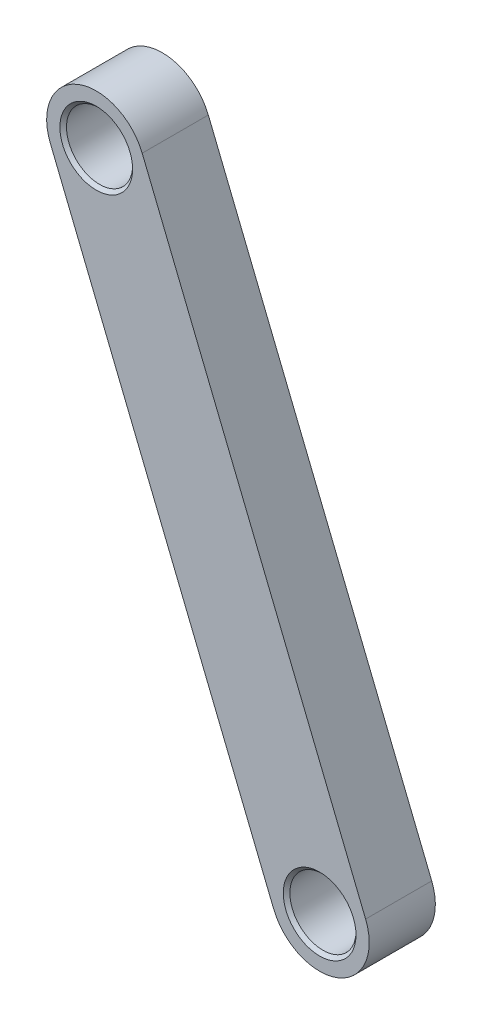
from build123d import *

# Parameters (mm, degrees)
ESQUISSE1_R        = 10
BOSS_EXTRU_1_DEPTH = 20
CHANFREIN1_SIZE    = 1


with BuildPart() as part:
    # Esquisse1 → Boss.-Extru.1 (new body)
    with BuildSketch(Plane.XY):
        with BuildLine():
            Line((47.81722947, 122.253745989), (-19.755015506, 289.088969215))
            ThreePointArc((-19.755015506, 289.088969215), (-11.483100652, 308.622924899), (8.050855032, 300.351010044))
            Line((8.050855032, 300.351010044), (75.623100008, 133.515786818))
            ThreePointArc((75.623100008, 133.515786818), (67.351185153, 113.981831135), (47.81722947, 122.253745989))
        make_face()
        with Locations((-5.852080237, 294.71998963)):
            Circle(ESQUISSE1_R, mode=Mode.SUBTRACT)
        with Locations((61.720164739, 127.884766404)):
            Circle(ESQUISSE1_R, mode=Mode.SUBTRACT)
    extrude(amount=BOSS_EXTRU_1_DEPTH)

    # Chanfrein1
    chanfrein1_edges = [part.edges().sort_by_distance(p)[0] for p in [
        (-15.852080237, 294.71998963, 0),
        (-15.852080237, 294.71998963, 20),
        (51.720164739, 127.884766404, 0),
        (51.720164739, 127.884766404, 20),
    ]]
    chamfer(chanfrein1_edges, length=CHANFREIN1_SIZE)


solid = part.part
